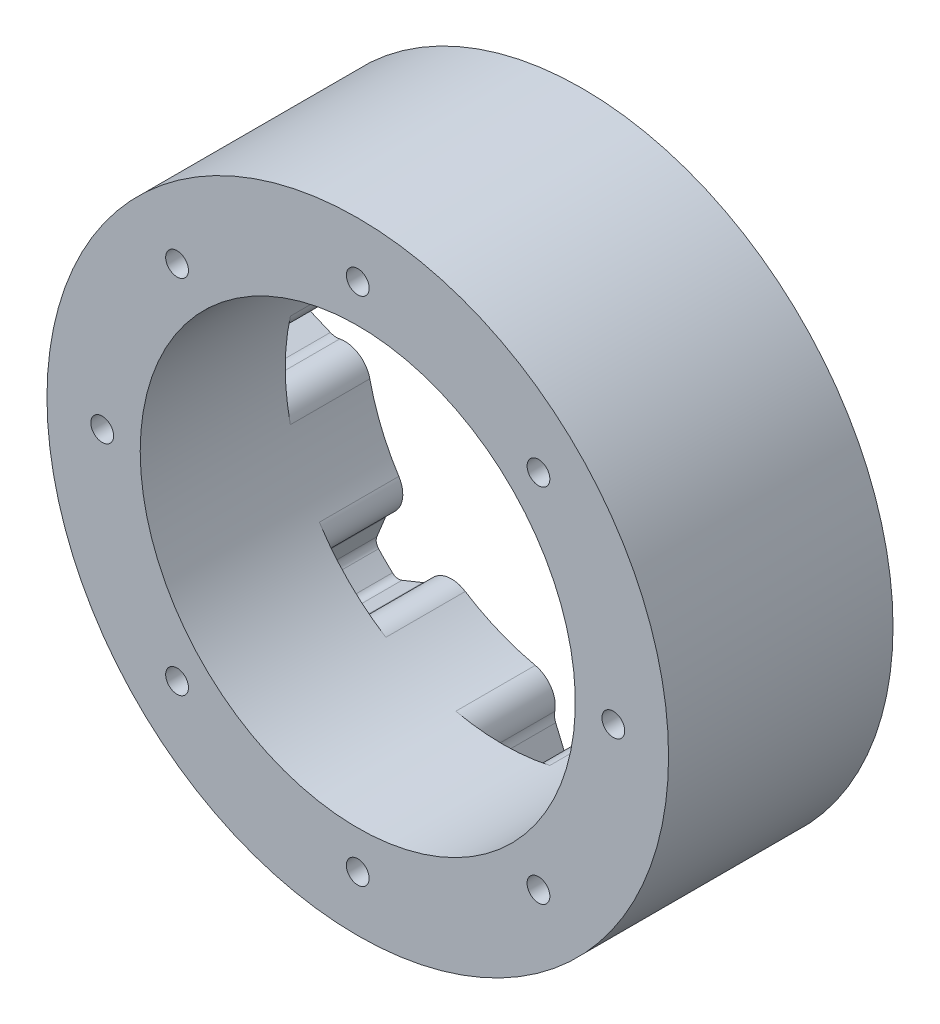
from build123d import *

# Parameters (mm, degrees)
SKETCH1_R           = 45
BOSS_EXTRUDE1_DEPTH = 16.25
CUT_EXTRUDE1_DEPTH  = 11.5
CIRPATTERN1_COUNT   = 8
SKETCH3_R           = 31.5
CUT_EXTRUDE2_DEPTH  = 72.45802964
SKETCH5_R           = 1.65
CUT_EXTRUDE4_DEPTH  = 68.014923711
CIRPATTERN2_COUNT   = 8


with BuildPart() as part:
    # Sketch1 → Boss-Extrude1 (new, symmetric)
    with BuildSketch(Plane(origin=(0, 0, 0), x_dir=(0, 1, 0), z_dir=(0, 0, 1))):
        with Locations(Location((0, 0, 0), (0, 0, 270))):
            Circle(SKETCH1_R)
    extrude(amount=BOSS_EXTRUDE1_DEPTH, both=True)

    # Sketch2 → Cut-Extrude1 (cut)
    with BuildSketch(Plane(origin=(0, 0, -16.25), x_dir=(1, 0, 0), z_dir=(0, 0, -1))):
        with BuildLine():
            Line((2.572221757, 39.48178759), (3.845069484, 36.469685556))
            ThreePointArc((3.845069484, 36.469685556), (4.015258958, 35.801181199), (3.979559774, 35.11227765))
            ThreePointArc((3.979559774, 35.11227765), (4.499845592, 32.35549412), (6.804807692, 30.756212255))
            ThreePointArc((6.804807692, 30.756212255), (0, 31.5), (-6.804807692, 30.756212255))
            ThreePointArc((-6.804807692, 30.756212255), (-4.499845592, 32.35549412), (-3.979559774, 35.11227765))
            ThreePointArc((-3.979559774, 35.11227765), (-4.015258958, 35.801181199), (-3.845069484, 36.469685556))
            Line((-3.845069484, 36.469685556), (-2.572221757, 39.48178759))
            ThreePointArc((-2.572221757, 39.48178759), (-2.112127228, 40.046404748), (-1.420575, 40.274954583))
            ThreePointArc((-1.420575, 40.274954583), (0, 40.3), (1.420575, 40.274954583))
            ThreePointArc((1.420575, 40.274954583), (2.112127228, 40.046404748), (2.572221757, 39.48178759))
        make_face()
    cut_extrude1 = extrude(amount=-CUT_EXTRUDE1_DEPTH, mode=Mode.SUBTRACT)

    # CirPattern1: Cut-Extrude1 ×8 about axis
    cirpattern1_axis = Axis((0, 0, 0), (0, 0, 1))
    for i in range(1, CIRPATTERN1_COUNT):
        add(cut_extrude1.rotate(cirpattern1_axis, i * 360 / CIRPATTERN1_COUNT), mode=Mode.SUBTRACT)

    # Sketch3 → Cut-Extrude2 (cut, through all)
    with BuildSketch(Plane(origin=(0, 0, -16.25), x_dir=(1, 0, 0), z_dir=(0, 0, -1))):
        with Locations(Location((0, 0, 0), (0, 0, 180))):
            Circle(SKETCH3_R)
    extrude(amount=-CUT_EXTRUDE2_DEPTH, mode=Mode.SUBTRACT)

    # Sketch5 → Cut-Extrude4 (cut, through all)
    with BuildSketch(Plane(origin=(0, 0, -4.75), x_dir=(1, 0, 0), z_dir=(0, 0, -1))):
        with Locations(Location((0, 37, 0), (0, 0, 180))):
            Circle(SKETCH5_R)
    cut_extrude4 = extrude(amount=-CUT_EXTRUDE4_DEPTH, mode=Mode.SUBTRACT)

    # CirPattern2: Cut-Extrude4 ×8 about axis
    cirpattern2_axis = Axis((0, 0, 0), (0, 0, 1))
    for i in range(1, CIRPATTERN2_COUNT):
        add(cut_extrude4.rotate(cirpattern2_axis, i * 360 / CIRPATTERN2_COUNT), mode=Mode.SUBTRACT)


solid = part.part
